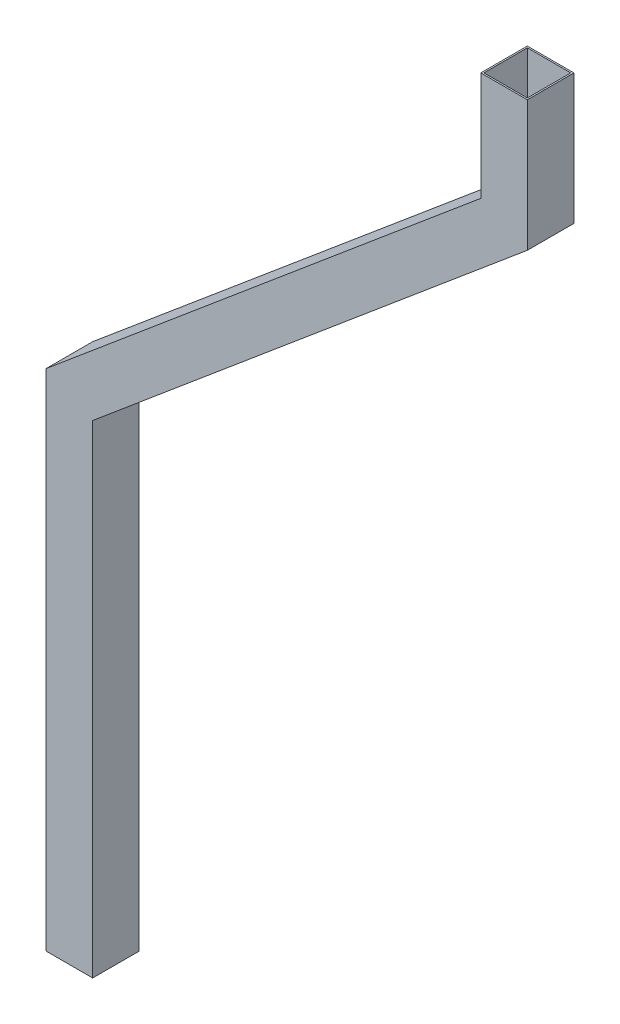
from build123d import *

# Parameters (mm, degrees)
SCHIZZO3_W   = 30
SCHIZZO3_H   = 30
SCHIZZO3_W_2 = 28
SCHIZZO3_H_2 = 28


with BuildPart() as part:
    # Sweep-Sottile1: sweep along a path in Schizzo1
    with BuildLine(Plane.XY) as sweep_sottile1_path:
        Line((0, 0), (0, 325))
        Line((0, 325), (280, 559.94789673))
        Line((280, 559.94789673), (280, 629.94789673))
    # Schizzo3 → Sweep-Sottile1 (sweep)
    with BuildSketch(Plane(origin=(0, 0, 0), x_dir=(1, 0, 0), z_dir=(0, 1, 0))):
        with Locations((15, -15)):
            Rectangle(SCHIZZO3_W, SCHIZZO3_H)
        with Locations((15, -15)):
            Rectangle(SCHIZZO3_W_2, SCHIZZO3_H_2, mode=Mode.SUBTRACT)
    sweep(path=sweep_sottile1_path.line, transition=Transition.RIGHT)


solid = part.part
